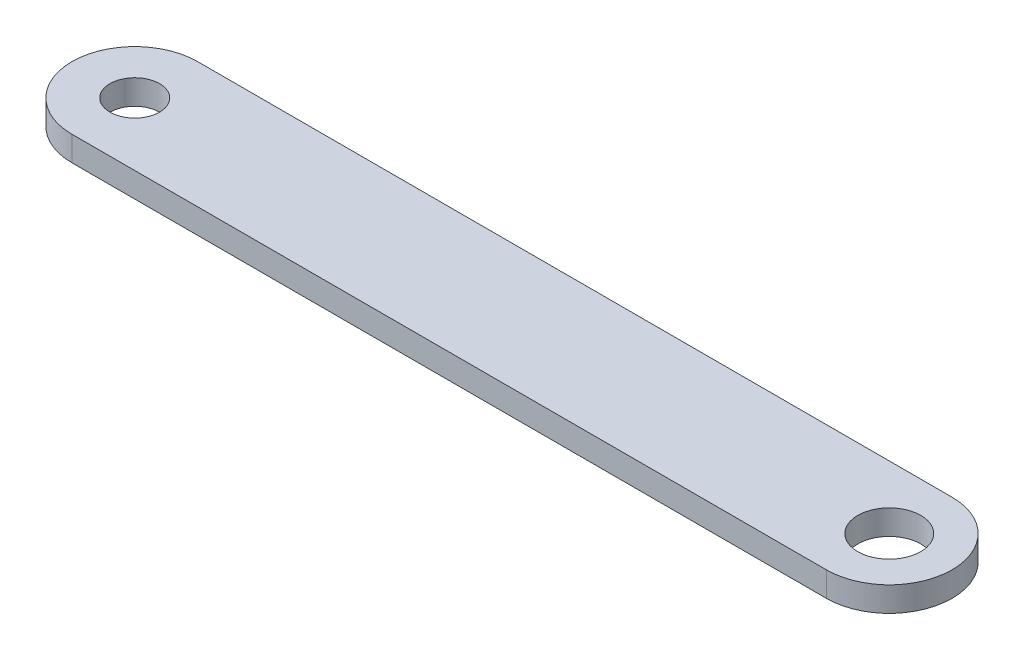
from build123d import *

# Parameters (mm, degrees)
BOSS_EXTRUDE1_DEPTH = 5
SKETCH2_R           = 5
CUT_EXTRUDE1_DEPTH  = 5
SKETCH4_R           = 6.35
CUT_EXTRUDE2_DEPTH  = 93.74848674


with BuildPart() as part:
    # Sketch1 → Boss-Extrude1 (new body)
    with BuildSketch(Plane(origin=(0, 0, 0), x_dir=(1, 0, 0), z_dir=(0, 1, 0))):
        with BuildLine():
            Line((-73.554166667, 11.377083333), (78.845833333, 11.377083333))
            ThreePointArc((78.845833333, 11.377083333), (91.545833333, -1.322916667), (78.845833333, -14.022916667))
            Line((78.845833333, -14.022916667), (-73.554166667, -14.022916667))
            ThreePointArc((-73.554166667, -14.022916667), (-86.254166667, -1.322916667), (-73.554166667, 11.377083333))
        make_face()
    extrude(amount=BOSS_EXTRUDE1_DEPTH)

    # Sketch2 → Cut-Extrude1 (cut)
    with BuildSketch(Plane(origin=(0, 0, 0), x_dir=(1, 0, 0), z_dir=(0, 1, 0))):
        with Locations(Location((-73.554166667, -1.322916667, 0), (0, 0, 270))):
            Circle(SKETCH2_R)
        with Locations(Location((78.845833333, -1.322916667, 0), (0, 0, 270))):
            Circle(SKETCH2_R)
    extrude(amount=CUT_EXTRUDE1_DEPTH, mode=Mode.SUBTRACT)

    # Sketch4 → Cut-Extrude2 (cut, through all)
    with BuildSketch(Plane.XZ):
        with Locations(Location((78.845833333, 1.322916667, 0), (0, 0, 270))):
            Circle(SKETCH4_R)
    extrude(amount=-CUT_EXTRUDE2_DEPTH, mode=Mode.SUBTRACT)


solid = part.part
